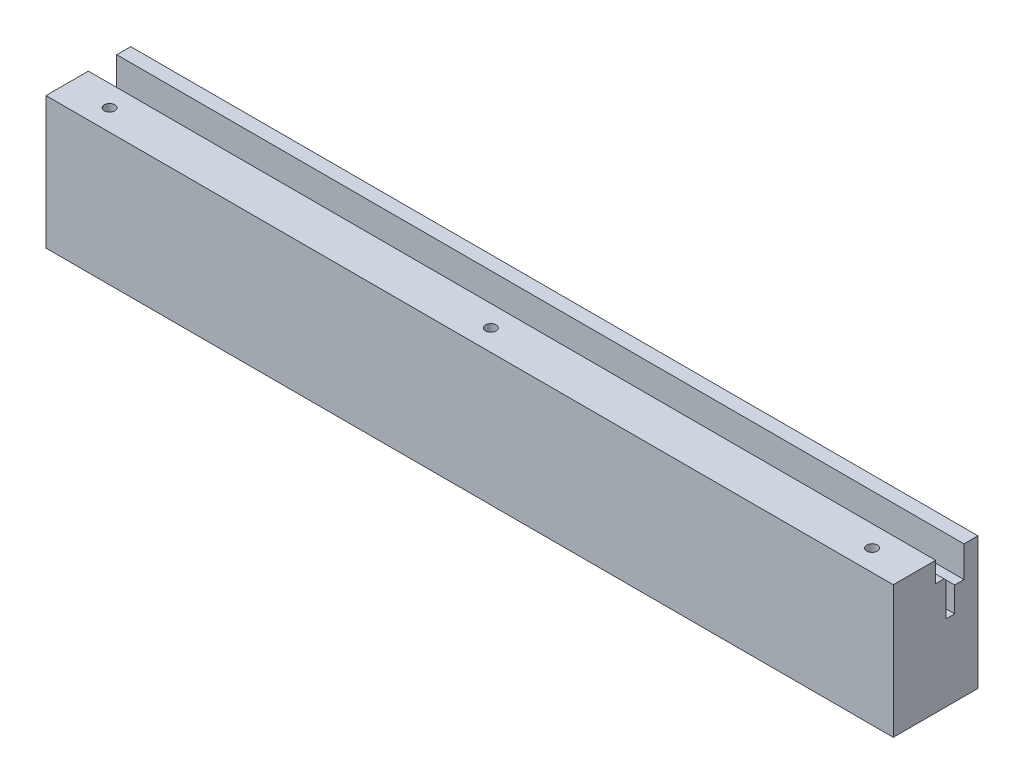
ISO-10303-21;
HEADER;
FILE_DESCRIPTION(('STEP AP214'),'2;1');
FILE_NAME('part.step','',(''),(''),'','','');
FILE_SCHEMA(('AUTOMOTIVE_DESIGN { 1 0 10303 214 1 1 1 1 }'));
ENDSEC;
DATA;
#1=APPLICATION_CONTEXT('core data for automotive mechanical design processes');
#2=APPLICATION_PROTOCOL_DEFINITION('international standard','automotive_design',2000,#1);
#3=PRODUCT_CONTEXT('',#1,'mechanical');
#4=PRODUCT('Part','Part','',(#3));
#5=PRODUCT_RELATED_PRODUCT_CATEGORY('part','',(#4));
#6=PRODUCT_DEFINITION_FORMATION('','',#4);
#7=PRODUCT_DEFINITION_CONTEXT('part definition',#1,'design');
#8=PRODUCT_DEFINITION('design','',#6,#7);
#9=PRODUCT_DEFINITION_SHAPE('','',#8);
#10=(LENGTH_UNIT() NAMED_UNIT(*) SI_UNIT(.MILLI.,.METRE.));
#11=(NAMED_UNIT(*) PLANE_ANGLE_UNIT() SI_UNIT($,.RADIAN.));
#12=(NAMED_UNIT(*) SI_UNIT($,.STERADIAN.) SOLID_ANGLE_UNIT());
#13=UNCERTAINTY_MEASURE_WITH_UNIT(LENGTH_MEASURE(1.E-05),#10,'distance_accuracy_value','');
#14=(GEOMETRIC_REPRESENTATION_CONTEXT(3) GLOBAL_UNCERTAINTY_ASSIGNED_CONTEXT((#13)) GLOBAL_UNIT_ASSIGNED_CONTEXT((#10,
#11,#12)) REPRESENTATION_CONTEXT('',''));
#15=CARTESIAN_POINT('',(0.,0.,0.));
#16=DIRECTION('',(0.,0.,1.));
#17=DIRECTION('',(1.,0.,0.));
#18=AXIS2_PLACEMENT_3D('',#15,#16,#17);
#19=CARTESIAN_POINT('',(0.,1.13686837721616E-13,20.));
#20=DIRECTION('',(1.,0.,0.));
#21=DIRECTION('',(0.,0.,-1.));
#22=AXIS2_PLACEMENT_3D('',#19,#20,#21);
#23=PLANE('',#22);
#24=DIRECTION('',(0.,-1.,0.));
#25=VECTOR('',#24,1.);
#26=CARTESIAN_POINT('',(0.,23.9000000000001,3.30000000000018));
#27=LINE('',#26,#25);
#28=CARTESIAN_POINT('',(0.,31.1999999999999,3.30000000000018));
#29=VERTEX_POINT('',#28);
#30=CARTESIAN_POINT('',(0.,23.9000000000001,3.30000000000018));
#31=VERTEX_POINT('',#30);
#32=EDGE_CURVE('E170',#29,#31,#27,.T.);
#33=ORIENTED_EDGE('',*,*,#32,.F.);
#34=DIRECTION('',(0.,0.,-1.));
#35=VECTOR('',#34,1.);
#36=CARTESIAN_POINT('',(0.,31.2,20.));
#37=LINE('',#36,#35);
#38=CARTESIAN_POINT('',(0.,31.2,0.));
#39=VERTEX_POINT('',#38);
#40=EDGE_CURVE('E78',#29,#39,#37,.T.);
#41=ORIENTED_EDGE('',*,*,#40,.T.);
#42=DIRECTION('',(0.,-1.,0.));
#43=VECTOR('',#42,1.);
#44=CARTESIAN_POINT('',(0.,1.13686837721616E-13,0.));
#45=LINE('',#44,#43);
#46=CARTESIAN_POINT('',(0.,1.13686837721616E-13,0.));
#47=VERTEX_POINT('',#46);
#48=EDGE_CURVE('E199',#39,#47,#45,.T.);
#49=ORIENTED_EDGE('',*,*,#48,.T.);
#50=DIRECTION('',(0.,0.,-1.));
#51=VECTOR('',#50,1.);
#52=CARTESIAN_POINT('',(0.,1.13686837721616E-13,20.));
#53=LINE('',#52,#51);
#54=CARTESIAN_POINT('',(0.,1.13686837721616E-13,20.));
#55=VERTEX_POINT('',#54);
#56=EDGE_CURVE('E12',#55,#47,#53,.T.);
#57=ORIENTED_EDGE('',*,*,#56,.F.);
#58=DIRECTION('',(0.,-1.,0.));
#59=VECTOR('',#58,1.);
#60=CARTESIAN_POINT('',(0.,1.13686837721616E-13,20.));
#61=LINE('',#60,#59);
#62=CARTESIAN_POINT('',(0.,31.2,20.));
#63=VERTEX_POINT('',#62);
#64=EDGE_CURVE('E214',#63,#55,#61,.T.);
#65=ORIENTED_EDGE('',*,*,#64,.F.);
#66=CARTESIAN_POINT('',(0.,31.2,10.));
#67=VERTEX_POINT('',#66);
#68=EDGE_CURVE('E228',#63,#67,#37,.T.);
#69=ORIENTED_EDGE('',*,*,#68,.T.);
#70=DIRECTION('',(0.,1.,-1.89373979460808E-13));
#71=VECTOR('',#70,1.);
#72=CARTESIAN_POINT('',(0.,26.4000000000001,10.0000000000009));
#73=LINE('',#72,#71);
#74=CARTESIAN_POINT('',(0.,26.4000000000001,10.0000000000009));
#75=VERTEX_POINT('',#74);
#76=EDGE_CURVE('E47',#75,#67,#73,.T.);
#77=ORIENTED_EDGE('',*,*,#76,.F.);
#78=DIRECTION('',(0.,0.,1.));
#79=VECTOR('',#78,1.);
#80=CARTESIAN_POINT('',(0.,26.4000000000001,10.0000000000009));
#81=LINE('',#80,#79);
#82=CARTESIAN_POINT('',(0.,26.4000000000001,8.));
#83=VERTEX_POINT('',#82);
#84=EDGE_CURVE('E163',#83,#75,#81,.T.);
#85=ORIENTED_EDGE('',*,*,#84,.F.);
#86=DIRECTION('',(0.,0.707106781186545,0.70710678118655));
#87=VECTOR('',#86,1.);
#88=CARTESIAN_POINT('',(0.,26.4000000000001,8.));
#89=LINE('',#88,#87);
#90=CARTESIAN_POINT('',(0.,25.9000000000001,7.5));
#91=VERTEX_POINT('',#90);
#92=EDGE_CURVE('E161',#91,#83,#89,.T.);
#93=ORIENTED_EDGE('',*,*,#92,.F.);
#94=DIRECTION('',(0.,1.,0.));
#95=VECTOR('',#94,1.);
#96=CARTESIAN_POINT('',(0.,18.,7.5));
#97=LINE('',#96,#95);
#98=CARTESIAN_POINT('',(0.,18.,7.5));
#99=VERTEX_POINT('',#98);
#100=EDGE_CURVE('E141',#99,#91,#97,.T.);
#101=ORIENTED_EDGE('',*,*,#100,.F.);
#102=DIRECTION('',(0.,0.,1.));
#103=VECTOR('',#102,1.);
#104=CARTESIAN_POINT('',(0.,18.,7.5));
#105=LINE('',#104,#103);
#106=CARTESIAN_POINT('',(0.,18.,5.5));
#107=VERTEX_POINT('',#106);
#108=EDGE_CURVE('E152',#107,#99,#105,.T.);
#109=ORIENTED_EDGE('',*,*,#108,.F.);
#110=DIRECTION('',(0.,-1.,0.));
#111=VECTOR('',#110,1.);
#112=CARTESIAN_POINT('',(0.,18.,5.5));
#113=LINE('',#112,#111);
#114=CARTESIAN_POINT('',(0.,23.9000000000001,5.5));
#115=VERTEX_POINT('',#114);
#116=EDGE_CURVE('E149',#115,#107,#113,.T.);
#117=ORIENTED_EDGE('',*,*,#116,.F.);
#118=DIRECTION('',(0.,0.,1.));
#119=VECTOR('',#118,1.);
#120=CARTESIAN_POINT('',(0.,23.9000000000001,5.5));
#121=LINE('',#120,#119);
#122=EDGE_CURVE('E173',#31,#115,#121,.T.);
#123=ORIENTED_EDGE('',*,*,#122,.F.);
#124=EDGE_LOOP('',(#33,#41,#49,#57,#65,#69,#77,#85,#93,#101,#109,#117,#123));
#125=FACE_BOUND('',#124,.T.);
#126=ADVANCED_FACE('F33',(#125),#23,.F.);
#127=CARTESIAN_POINT('',(200.,1.13686837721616E-13,20.));
#128=DIRECTION('',(-1.,0.,0.));
#129=DIRECTION('',(0.,0.,1.));
#130=AXIS2_PLACEMENT_3D('',#127,#128,#129);
#131=PLANE('',#130);
#132=DIRECTION('',(0.,-1.,0.));
#133=VECTOR('',#132,1.);
#134=CARTESIAN_POINT('',(200.,23.9000000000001,3.30000000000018));
#135=LINE('',#134,#133);
#136=CARTESIAN_POINT('',(200.,31.1999999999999,3.30000000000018));
#137=VERTEX_POINT('',#136);
#138=CARTESIAN_POINT('',(200.,23.9000000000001,3.30000000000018));
#139=VERTEX_POINT('',#138);
#140=EDGE_CURVE('E190',#137,#139,#135,.T.);
#141=ORIENTED_EDGE('',*,*,#140,.T.);
#142=DIRECTION('',(0.,0.,1.));
#143=VECTOR('',#142,1.);
#144=CARTESIAN_POINT('',(200.,23.9000000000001,5.5));
#145=LINE('',#144,#143);
#146=CARTESIAN_POINT('',(200.,23.9000000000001,5.5));
#147=VERTEX_POINT('',#146);
#148=EDGE_CURVE('E193',#139,#147,#145,.T.);
#149=ORIENTED_EDGE('',*,*,#148,.T.);
#150=DIRECTION('',(0.,-1.,0.));
#151=VECTOR('',#150,1.);
#152=CARTESIAN_POINT('',(200.,18.,5.5));
#153=LINE('',#152,#151);
#154=CARTESIAN_POINT('',(200.,18.,5.5));
#155=VERTEX_POINT('',#154);
#156=EDGE_CURVE('E157',#147,#155,#153,.T.);
#157=ORIENTED_EDGE('',*,*,#156,.T.);
#158=DIRECTION('',(0.,0.,1.));
#159=VECTOR('',#158,1.);
#160=CARTESIAN_POINT('',(200.,18.,7.5));
#161=LINE('',#160,#159);
#162=CARTESIAN_POINT('',(200.,18.,7.5));
#163=VERTEX_POINT('',#162);
#164=EDGE_CURVE('E177',#155,#163,#161,.T.);
#165=ORIENTED_EDGE('',*,*,#164,.T.);
#166=DIRECTION('',(0.,1.,0.));
#167=VECTOR('',#166,1.);
#168=CARTESIAN_POINT('',(200.,18.,7.5));
#169=LINE('',#168,#167);
#170=CARTESIAN_POINT('',(200.,25.9000000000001,7.5));
#171=VERTEX_POINT('',#170);
#172=EDGE_CURVE('E144',#163,#171,#169,.T.);
#173=ORIENTED_EDGE('',*,*,#172,.T.);
#174=DIRECTION('',(0.,0.707106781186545,0.70710678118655));
#175=VECTOR('',#174,1.);
#176=CARTESIAN_POINT('',(200.,26.4000000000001,8.));
#177=LINE('',#176,#175);
#178=CARTESIAN_POINT('',(200.,26.4000000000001,8.));
#179=VERTEX_POINT('',#178);
#180=EDGE_CURVE('E181',#171,#179,#177,.T.);
#181=ORIENTED_EDGE('',*,*,#180,.T.);
#182=DIRECTION('',(0.,0.,1.));
#183=VECTOR('',#182,1.);
#184=CARTESIAN_POINT('',(200.,26.4000000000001,10.0000000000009));
#185=LINE('',#184,#183);
#186=CARTESIAN_POINT('',(200.,26.4000000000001,10.0000000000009));
#187=VERTEX_POINT('',#186);
#188=EDGE_CURVE('E184',#179,#187,#185,.T.);
#189=ORIENTED_EDGE('',*,*,#188,.T.);
#190=DIRECTION('',(0.,1.,-1.89373979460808E-13));
#191=VECTOR('',#190,1.);
#192=CARTESIAN_POINT('',(200.,26.4000000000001,10.0000000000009));
#193=LINE('',#192,#191);
#194=CARTESIAN_POINT('',(200.,31.1999999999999,10.));
#195=VERTEX_POINT('',#194);
#196=EDGE_CURVE('E187',#187,#195,#193,.T.);
#197=ORIENTED_EDGE('',*,*,#196,.T.);
#198=DIRECTION('',(0.,0.,-1.));
#199=VECTOR('',#198,1.);
#200=CARTESIAN_POINT('',(200.,31.2,20.));
#201=LINE('',#200,#199);
#202=CARTESIAN_POINT('',(200.,31.2,20.));
#203=VERTEX_POINT('',#202);
#204=EDGE_CURVE('E232',#203,#195,#201,.T.);
#205=ORIENTED_EDGE('',*,*,#204,.F.);
#206=DIRECTION('',(0.,1.,0.));
#207=VECTOR('',#206,1.);
#208=CARTESIAN_POINT('',(200.,1.13686837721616E-13,20.));
#209=LINE('',#208,#207);
#210=CARTESIAN_POINT('',(200.,1.13686837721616E-13,20.));
#211=VERTEX_POINT('',#210);
#212=EDGE_CURVE('E218',#211,#203,#209,.T.);
#213=ORIENTED_EDGE('',*,*,#212,.F.);
#214=DIRECTION('',(0.,0.,-1.));
#215=VECTOR('',#214,1.);
#216=CARTESIAN_POINT('',(200.,1.13686837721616E-13,20.));
#217=LINE('',#216,#215);
#218=CARTESIAN_POINT('',(200.,1.13686837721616E-13,0.));
#219=VERTEX_POINT('',#218);
#220=EDGE_CURVE('E40',#211,#219,#217,.T.);
#221=ORIENTED_EDGE('',*,*,#220,.T.);
#222=DIRECTION('',(0.,1.,0.));
#223=VECTOR('',#222,1.);
#224=CARTESIAN_POINT('',(200.,1.13686837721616E-13,0.));
#225=LINE('',#224,#223);
#226=CARTESIAN_POINT('',(200.,31.2,0.));
#227=VERTEX_POINT('',#226);
#228=EDGE_CURVE('E224',#219,#227,#225,.T.);
#229=ORIENTED_EDGE('',*,*,#228,.T.);
#230=EDGE_CURVE('E231',#137,#227,#201,.T.);
#231=ORIENTED_EDGE('',*,*,#230,.F.);
#232=EDGE_LOOP('',(#141,#149,#157,#165,#173,#181,#189,#197,#205,#213,#221,#229,#231));
#233=FACE_BOUND('',#232,.T.);
#234=ADVANCED_FACE('F238',(#233),#131,.F.);
#235=CARTESIAN_POINT('',(0.,31.2,20.));
#236=DIRECTION('',(0.,-1.,0.));
#237=DIRECTION('',(0.,0.,-1.));
#238=AXIS2_PLACEMENT_3D('',#235,#236,#237);
#239=PLANE('',#238);
#240=DIRECTION('',(1.,0.,0.));
#241=VECTOR('',#240,1.);
#242=CARTESIAN_POINT('',(0.,31.1999999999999,3.30000000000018));
#243=LINE('',#242,#241);
#244=EDGE_CURVE('E204',#29,#137,#243,.T.);
#245=ORIENTED_EDGE('',*,*,#244,.T.);
#246=ORIENTED_EDGE('',*,*,#230,.T.);
#247=DIRECTION('',(-1.,0.,0.));
#248=VECTOR('',#247,1.);
#249=CARTESIAN_POINT('',(0.,31.2,0.));
#250=LINE('',#249,#248);
#251=EDGE_CURVE('E216',#227,#39,#250,.T.);
#252=ORIENTED_EDGE('',*,*,#251,.T.);
#253=ORIENTED_EDGE('',*,*,#40,.F.);
#254=EDGE_LOOP('',(#245,#246,#252,#253));
#255=FACE_BOUND('',#254,.T.);
#256=ADVANCED_FACE('F246',(#255),#239,.F.);
#257=CARTESIAN_POINT('',(190.,31.2,15.));
#258=DIRECTION('',(0.,1.,0.));
#259=DIRECTION('',(0.,0.,1.));
#260=AXIS2_PLACEMENT_3D('',#257,#258,#259);
#261=CIRCLE('',#260,1.25);
#262=CARTESIAN_POINT('',(190.,31.2,16.25));
#263=VERTEX_POINT('',#262);
#264=EDGE_CURVE('E297',#263,#263,#261,.T.);
#265=ORIENTED_EDGE('',*,*,#264,.F.);
#266=EDGE_LOOP('',(#265));
#267=FACE_BOUND('',#266,.T.);
#268=CARTESIAN_POINT('',(100.,31.2,15.));
#269=DIRECTION('',(0.,1.,0.));
#270=DIRECTION('',(0.,0.,1.));
#271=AXIS2_PLACEMENT_3D('',#268,#269,#270);
#272=CIRCLE('',#271,1.25);
#273=CARTESIAN_POINT('',(100.,31.2,16.25));
#274=VERTEX_POINT('',#273);
#275=EDGE_CURVE('E301',#274,#274,#272,.T.);
#276=ORIENTED_EDGE('',*,*,#275,.F.);
#277=EDGE_LOOP('',(#276));
#278=FACE_BOUND('',#277,.T.);
#279=CARTESIAN_POINT('',(10.,31.2,15.));
#280=DIRECTION('',(0.,1.,0.));
#281=DIRECTION('',(0.,0.,1.));
#282=AXIS2_PLACEMENT_3D('',#279,#280,#281);
#283=CIRCLE('',#282,1.25);
#284=CARTESIAN_POINT('',(10.,31.2,16.25));
#285=VERTEX_POINT('',#284);
#286=EDGE_CURVE('E304',#285,#285,#283,.T.);
#287=ORIENTED_EDGE('',*,*,#286,.F.);
#288=EDGE_LOOP('',(#287));
#289=FACE_BOUND('',#288,.T.);
#290=DIRECTION('',(1.,0.,0.));
#291=VECTOR('',#290,1.);
#292=CARTESIAN_POINT('',(0.,31.1999999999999,10.));
#293=LINE('',#292,#291);
#294=EDGE_CURVE('E207',#67,#195,#293,.T.);
#295=ORIENTED_EDGE('',*,*,#294,.F.);
#296=ORIENTED_EDGE('',*,*,#68,.F.);
#297=DIRECTION('',(-1.,0.,0.));
#298=VECTOR('',#297,1.);
#299=CARTESIAN_POINT('',(0.,31.2,20.));
#300=LINE('',#299,#298);
#301=EDGE_CURVE('E56',#203,#63,#300,.T.);
#302=ORIENTED_EDGE('',*,*,#301,.F.);
#303=ORIENTED_EDGE('',*,*,#204,.T.);
#304=EDGE_LOOP('',(#295,#296,#302,#303));
#305=FACE_BOUND('',#304,.T.);
#306=ADVANCED_FACE('F265',(#267,#278,#289,#305),#239,.F.);
#307=CARTESIAN_POINT('',(0.,1.13686837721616E-13,20.));
#308=DIRECTION('',(0.,1.,0.));
#309=DIRECTION('',(0.,0.,1.));
#310=AXIS2_PLACEMENT_3D('',#307,#308,#309);
#311=PLANE('',#310);
#312=CARTESIAN_POINT('',(180.,0.,15.));
#313=DIRECTION('',(0.,-1.,0.));
#314=DIRECTION('',(0.,0.,-1.));
#315=AXIS2_PLACEMENT_3D('',#312,#313,#314);
#316=CIRCLE('',#315,2.09999999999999);
#317=CARTESIAN_POINT('',(180.,0.,12.9));
#318=VERTEX_POINT('',#317);
#319=EDGE_CURVE('E324',#318,#318,#316,.T.);
#320=ORIENTED_EDGE('',*,*,#319,.F.);
#321=EDGE_LOOP('',(#320));
#322=FACE_BOUND('',#321,.T.);
#323=CARTESIAN_POINT('',(132.400000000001,0.,15.));
#324=DIRECTION('',(0.,-1.,0.));
#325=DIRECTION('',(0.,0.,-1.));
#326=AXIS2_PLACEMENT_3D('',#323,#324,#325);
#327=CIRCLE('',#326,2.09999999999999);
#328=CARTESIAN_POINT('',(132.400000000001,0.,12.9));
#329=VERTEX_POINT('',#328);
#330=EDGE_CURVE('E318',#329,#329,#327,.T.);
#331=ORIENTED_EDGE('',*,*,#330,.F.);
#332=EDGE_LOOP('',(#331));
#333=FACE_BOUND('',#332,.T.);
#334=DIRECTION('',(1.,0.,0.));
#335=VECTOR('',#334,1.);
#336=CARTESIAN_POINT('',(0.,1.13686837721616E-13,0.));
#337=LINE('',#336,#335);
#338=EDGE_CURVE('E222',#47,#219,#337,.T.);
#339=ORIENTED_EDGE('',*,*,#338,.T.);
#340=ORIENTED_EDGE('',*,*,#220,.F.);
#341=DIRECTION('',(1.,0.,0.));
#342=VECTOR('',#341,1.);
#343=CARTESIAN_POINT('',(0.,1.13686837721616E-13,20.));
#344=LINE('',#343,#342);
#345=EDGE_CURVE('E85',#55,#211,#344,.T.);
#346=ORIENTED_EDGE('',*,*,#345,.F.);
#347=ORIENTED_EDGE('',*,*,#56,.T.);
#348=EDGE_LOOP('',(#339,#340,#346,#347));
#349=FACE_BOUND('',#348,.T.);
#350=ADVANCED_FACE('F270',(#322,#333,#349),#311,.F.);
#351=CARTESIAN_POINT('',(0.,31.2,20.));
#352=DIRECTION('',(0.,0.,-1.));
#353=DIRECTION('',(-1.,0.,0.));
#354=AXIS2_PLACEMENT_3D('',#351,#352,#353);
#355=PLANE('',#354);
#356=ORIENTED_EDGE('',*,*,#64,.T.);
#357=ORIENTED_EDGE('',*,*,#345,.T.);
#358=ORIENTED_EDGE('',*,*,#212,.T.);
#359=ORIENTED_EDGE('',*,*,#301,.T.);
#360=EDGE_LOOP('',(#356,#357,#358,#359));
#361=FACE_BOUND('',#360,.T.);
#362=ADVANCED_FACE('F268',(#361),#355,.F.);
#363=CARTESIAN_POINT('',(0.,31.2,0.));
#364=DIRECTION('',(0.,0.,-1.));
#365=DIRECTION('',(-1.,0.,0.));
#366=AXIS2_PLACEMENT_3D('',#363,#364,#365);
#367=PLANE('',#366);
#368=ORIENTED_EDGE('',*,*,#48,.F.);
#369=ORIENTED_EDGE('',*,*,#251,.F.);
#370=ORIENTED_EDGE('',*,*,#228,.F.);
#371=ORIENTED_EDGE('',*,*,#338,.F.);
#372=EDGE_LOOP('',(#368,#369,#370,#371));
#373=FACE_BOUND('',#372,.T.);
#374=ADVANCED_FACE('F244',(#373),#367,.T.);
#375=CARTESIAN_POINT('',(0.,18.,7.5));
#376=DIRECTION('',(0.,1.,0.));
#377=DIRECTION('',(0.,0.,1.));
#378=AXIS2_PLACEMENT_3D('',#375,#376,#377);
#379=PLANE('',#378);
#380=ORIENTED_EDGE('',*,*,#164,.F.);
#381=DIRECTION('',(1.,0.,0.));
#382=VECTOR('',#381,1.);
#383=CARTESIAN_POINT('',(0.,18.,5.5));
#384=LINE('',#383,#382);
#385=EDGE_CURVE('E154',#107,#155,#384,.T.);
#386=ORIENTED_EDGE('',*,*,#385,.F.);
#387=ORIENTED_EDGE('',*,*,#108,.T.);
#388=DIRECTION('',(1.,0.,0.));
#389=VECTOR('',#388,1.);
#390=CARTESIAN_POINT('',(0.,18.,7.5));
#391=LINE('',#390,#389);
#392=EDGE_CURVE('E137',#99,#163,#391,.T.);
#393=ORIENTED_EDGE('',*,*,#392,.T.);
#394=EDGE_LOOP('',(#380,#386,#387,#393));
#395=FACE_BOUND('',#394,.T.);
#396=ADVANCED_FACE('F153',(#395),#379,.T.);
#397=CARTESIAN_POINT('',(0.,18.,5.5));
#398=DIRECTION('',(0.,0.,1.));
#399=DIRECTION('',(1.,0.,0.));
#400=AXIS2_PLACEMENT_3D('',#397,#398,#399);
#401=PLANE('',#400);
#402=ORIENTED_EDGE('',*,*,#156,.F.);
#403=DIRECTION('',(1.,0.,0.));
#404=VECTOR('',#403,1.);
#405=CARTESIAN_POINT('',(0.,23.9000000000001,5.5));
#406=LINE('',#405,#404);
#407=EDGE_CURVE('E200',#115,#147,#406,.T.);
#408=ORIENTED_EDGE('',*,*,#407,.F.);
#409=ORIENTED_EDGE('',*,*,#116,.T.);
#410=ORIENTED_EDGE('',*,*,#385,.T.);
#411=EDGE_LOOP('',(#402,#408,#409,#410));
#412=FACE_BOUND('',#411,.T.);
#413=ADVANCED_FACE('F255',(#412),#401,.T.);
#414=CARTESIAN_POINT('',(0.,23.9000000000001,5.5));
#415=DIRECTION('',(0.,1.,0.));
#416=DIRECTION('',(0.,0.,1.));
#417=AXIS2_PLACEMENT_3D('',#414,#415,#416);
#418=PLANE('',#417);
#419=ORIENTED_EDGE('',*,*,#148,.F.);
#420=DIRECTION('',(1.,0.,0.));
#421=VECTOR('',#420,1.);
#422=CARTESIAN_POINT('',(0.,23.9000000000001,3.30000000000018));
#423=LINE('',#422,#421);
#424=EDGE_CURVE('E202',#31,#139,#423,.T.);
#425=ORIENTED_EDGE('',*,*,#424,.F.);
#426=ORIENTED_EDGE('',*,*,#122,.T.);
#427=ORIENTED_EDGE('',*,*,#407,.T.);
#428=EDGE_LOOP('',(#419,#425,#426,#427));
#429=FACE_BOUND('',#428,.T.);
#430=ADVANCED_FACE('F252',(#429),#418,.T.);
#431=CARTESIAN_POINT('',(0.,23.9000000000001,3.30000000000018));
#432=DIRECTION('',(0.,0.,1.));
#433=DIRECTION('',(1.,0.,0.));
#434=AXIS2_PLACEMENT_3D('',#431,#432,#433);
#435=PLANE('',#434);
#436=ORIENTED_EDGE('',*,*,#140,.F.);
#437=ORIENTED_EDGE('',*,*,#244,.F.);
#438=ORIENTED_EDGE('',*,*,#32,.T.);
#439=ORIENTED_EDGE('',*,*,#424,.T.);
#440=EDGE_LOOP('',(#436,#437,#438,#439));
#441=FACE_BOUND('',#440,.T.);
#442=ADVANCED_FACE('F249',(#441),#435,.T.);
#443=CARTESIAN_POINT('',(0.,26.4000000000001,10.0000000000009));
#444=DIRECTION('',(0.,-1.89373979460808E-13,-1.));
#445=DIRECTION('',(0.,1.,-1.89373979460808E-13));
#446=AXIS2_PLACEMENT_3D('',#443,#444,#445);
#447=PLANE('',#446);
#448=ORIENTED_EDGE('',*,*,#196,.F.);
#449=DIRECTION('',(1.,0.,0.));
#450=VECTOR('',#449,1.);
#451=CARTESIAN_POINT('',(0.,26.4000000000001,10.0000000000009));
#452=LINE('',#451,#450);
#453=EDGE_CURVE('E209',#75,#187,#452,.T.);
#454=ORIENTED_EDGE('',*,*,#453,.F.);
#455=ORIENTED_EDGE('',*,*,#76,.T.);
#456=ORIENTED_EDGE('',*,*,#294,.T.);
#457=EDGE_LOOP('',(#448,#454,#455,#456));
#458=FACE_BOUND('',#457,.T.);
#459=ADVANCED_FACE('F263',(#458),#447,.T.);
#460=CARTESIAN_POINT('',(0.,26.4000000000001,10.0000000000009));
#461=DIRECTION('',(0.,1.,0.));
#462=DIRECTION('',(0.,0.,1.));
#463=AXIS2_PLACEMENT_3D('',#460,#461,#462);
#464=PLANE('',#463);
#465=ORIENTED_EDGE('',*,*,#188,.F.);
#466=DIRECTION('',(1.,0.,0.));
#467=VECTOR('',#466,1.);
#468=CARTESIAN_POINT('',(0.,26.4000000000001,8.));
#469=LINE('',#468,#467);
#470=EDGE_CURVE('E211',#83,#179,#469,.T.);
#471=ORIENTED_EDGE('',*,*,#470,.F.);
#472=ORIENTED_EDGE('',*,*,#84,.T.);
#473=ORIENTED_EDGE('',*,*,#453,.T.);
#474=EDGE_LOOP('',(#465,#471,#472,#473));
#475=FACE_BOUND('',#474,.T.);
#476=ADVANCED_FACE('F261',(#475),#464,.T.);
#477=CARTESIAN_POINT('',(0.,26.4000000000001,8.));
#478=DIRECTION('',(0.,0.70710678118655,-0.707106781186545));
#479=DIRECTION('',(0.,0.707106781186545,0.70710678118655));
#480=AXIS2_PLACEMENT_3D('',#477,#478,#479);
#481=PLANE('',#480);
#482=ORIENTED_EDGE('',*,*,#180,.F.);
#483=DIRECTION('',(1.,0.,0.));
#484=VECTOR('',#483,1.);
#485=CARTESIAN_POINT('',(0.,25.9000000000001,7.5));
#486=LINE('',#485,#484);
#487=EDGE_CURVE('E148',#91,#171,#486,.T.);
#488=ORIENTED_EDGE('',*,*,#487,.F.);
#489=ORIENTED_EDGE('',*,*,#92,.T.);
#490=ORIENTED_EDGE('',*,*,#470,.T.);
#491=EDGE_LOOP('',(#482,#488,#489,#490));
#492=FACE_BOUND('',#491,.T.);
#493=ADVANCED_FACE('F259',(#492),#481,.T.);
#494=CARTESIAN_POINT('',(0.,18.,7.5));
#495=DIRECTION('',(0.,0.,-1.));
#496=DIRECTION('',(-1.,0.,0.));
#497=AXIS2_PLACEMENT_3D('',#494,#495,#496);
#498=PLANE('',#497);
#499=ORIENTED_EDGE('',*,*,#172,.F.);
#500=ORIENTED_EDGE('',*,*,#392,.F.);
#501=ORIENTED_EDGE('',*,*,#100,.T.);
#502=ORIENTED_EDGE('',*,*,#487,.T.);
#503=EDGE_LOOP('',(#499,#500,#501,#502));
#504=FACE_BOUND('',#503,.T.);
#505=ADVANCED_FACE('F139',(#504),#498,.T.);
#506=CARTESIAN_POINT('',(10.,11.2,15.));
#507=DIRECTION('',(0.,1.,0.));
#508=DIRECTION('',(0.,0.,1.));
#509=AXIS2_PLACEMENT_3D('',#506,#507,#508);
#510=CYLINDRICAL_SURFACE('',#509,1.25);
#511=CARTESIAN_POINT('',(10.,11.2,15.));
#512=DIRECTION('',(0.,1.,0.));
#513=DIRECTION('',(0.,0.,1.));
#514=AXIS2_PLACEMENT_3D('',#511,#512,#513);
#515=CIRCLE('',#514,1.25);
#516=CARTESIAN_POINT('',(10.,11.2,16.25));
#517=VERTEX_POINT('',#516);
#518=EDGE_CURVE('E179',#517,#517,#515,.T.);
#519=ORIENTED_EDGE('',*,*,#518,.F.);
#520=EDGE_LOOP('',(#519));
#521=FACE_BOUND('',#520,.T.);
#522=ORIENTED_EDGE('',*,*,#286,.T.);
#523=EDGE_LOOP('',(#522));
#524=FACE_BOUND('',#523,.T.);
#525=ADVANCED_FACE('F371',(#521,#524),#510,.F.);
#526=CARTESIAN_POINT('',(10.,11.2,15.));
#527=DIRECTION('',(0.,1.,0.));
#528=DIRECTION('',(0.,0.,1.));
#529=AXIS2_PLACEMENT_3D('',#526,#527,#528);
#530=PLANE('',#529);
#531=ORIENTED_EDGE('',*,*,#518,.T.);
#532=EDGE_LOOP('',(#531));
#533=FACE_BOUND('',#532,.T.);
#534=ADVANCED_FACE('F367',(#533),#530,.T.);
#535=CARTESIAN_POINT('',(100.,11.2,15.));
#536=DIRECTION('',(0.,1.,0.));
#537=DIRECTION('',(0.,0.,1.));
#538=AXIS2_PLACEMENT_3D('',#535,#536,#537);
#539=CYLINDRICAL_SURFACE('',#538,1.25);
#540=CARTESIAN_POINT('',(100.,11.2,15.));
#541=DIRECTION('',(0.,1.,0.));
#542=DIRECTION('',(0.,0.,1.));
#543=AXIS2_PLACEMENT_3D('',#540,#541,#542);
#544=CIRCLE('',#543,1.25);
#545=CARTESIAN_POINT('',(100.,11.2,16.25));
#546=VERTEX_POINT('',#545);
#547=EDGE_CURVE('E306',#546,#546,#544,.T.);
#548=ORIENTED_EDGE('',*,*,#547,.F.);
#549=EDGE_LOOP('',(#548));
#550=FACE_BOUND('',#549,.T.);
#551=ORIENTED_EDGE('',*,*,#275,.T.);
#552=EDGE_LOOP('',(#551));
#553=FACE_BOUND('',#552,.T.);
#554=ADVANCED_FACE('F363',(#550,#553),#539,.F.);
#555=CARTESIAN_POINT('',(100.,11.2,15.));
#556=DIRECTION('',(0.,1.,0.));
#557=DIRECTION('',(0.,0.,1.));
#558=AXIS2_PLACEMENT_3D('',#555,#556,#557);
#559=PLANE('',#558);
#560=ORIENTED_EDGE('',*,*,#547,.T.);
#561=EDGE_LOOP('',(#560));
#562=FACE_BOUND('',#561,.T.);
#563=ADVANCED_FACE('F359',(#562),#559,.T.);
#564=CARTESIAN_POINT('',(190.,11.2,15.));
#565=DIRECTION('',(0.,1.,0.));
#566=DIRECTION('',(0.,0.,1.));
#567=AXIS2_PLACEMENT_3D('',#564,#565,#566);
#568=CYLINDRICAL_SURFACE('',#567,1.25);
#569=CARTESIAN_POINT('',(190.,11.2,15.));
#570=DIRECTION('',(0.,1.,0.));
#571=DIRECTION('',(0.,0.,1.));
#572=AXIS2_PLACEMENT_3D('',#569,#570,#571);
#573=CIRCLE('',#572,1.25);
#574=CARTESIAN_POINT('',(190.,11.2,16.25));
#575=VERTEX_POINT('',#574);
#576=EDGE_CURVE('E312',#575,#575,#573,.T.);
#577=ORIENTED_EDGE('',*,*,#576,.F.);
#578=EDGE_LOOP('',(#577));
#579=FACE_BOUND('',#578,.T.);
#580=ORIENTED_EDGE('',*,*,#264,.T.);
#581=EDGE_LOOP('',(#580));
#582=FACE_BOUND('',#581,.T.);
#583=ADVANCED_FACE('F352',(#579,#582),#568,.F.);
#584=CARTESIAN_POINT('',(190.,11.2,15.));
#585=DIRECTION('',(0.,1.,0.));
#586=DIRECTION('',(0.,0.,1.));
#587=AXIS2_PLACEMENT_3D('',#584,#585,#586);
#588=PLANE('',#587);
#589=ORIENTED_EDGE('',*,*,#576,.T.);
#590=EDGE_LOOP('',(#589));
#591=FACE_BOUND('',#590,.T.);
#592=ADVANCED_FACE('F343',(#591),#588,.T.);
#593=CARTESIAN_POINT('',(132.400000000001,20.,15.));
#594=DIRECTION('',(0.,-1.,0.));
#595=DIRECTION('',(0.,0.,-1.));
#596=AXIS2_PLACEMENT_3D('',#593,#594,#595);
#597=CYLINDRICAL_SURFACE('',#596,2.09999999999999);
#598=CARTESIAN_POINT('',(132.400000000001,20.,15.));
#599=DIRECTION('',(0.,-1.,0.));
#600=DIRECTION('',(0.,0.,-1.));
#601=AXIS2_PLACEMENT_3D('',#598,#599,#600);
#602=CIRCLE('',#601,2.09999999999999);
#603=CARTESIAN_POINT('',(132.400000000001,20.,12.9));
#604=VERTEX_POINT('',#603);
#605=EDGE_CURVE('E315',#604,#604,#602,.T.);
#606=ORIENTED_EDGE('',*,*,#605,.F.);
#607=EDGE_LOOP('',(#606));
#608=FACE_BOUND('',#607,.T.);
#609=ORIENTED_EDGE('',*,*,#330,.T.);
#610=EDGE_LOOP('',(#609));
#611=FACE_BOUND('',#610,.T.);
#612=ADVANCED_FACE('F341',(#608,#611),#597,.F.);
#613=CARTESIAN_POINT('',(132.400000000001,20.,15.));
#614=DIRECTION('',(0.,-1.,0.));
#615=DIRECTION('',(0.,0.,-1.));
#616=AXIS2_PLACEMENT_3D('',#613,#614,#615);
#617=PLANE('',#616);
#618=ORIENTED_EDGE('',*,*,#605,.T.);
#619=EDGE_LOOP('',(#618));
#620=FACE_BOUND('',#619,.T.);
#621=ADVANCED_FACE('F335',(#620),#617,.T.);
#622=CARTESIAN_POINT('',(180.,20.,15.));
#623=DIRECTION('',(0.,-1.,0.));
#624=DIRECTION('',(0.,0.,-1.));
#625=AXIS2_PLACEMENT_3D('',#622,#623,#624);
#626=CYLINDRICAL_SURFACE('',#625,2.09999999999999);
#627=CARTESIAN_POINT('',(180.,20.,15.));
#628=DIRECTION('',(0.,-1.,0.));
#629=DIRECTION('',(0.,0.,-1.));
#630=AXIS2_PLACEMENT_3D('',#627,#628,#629);
#631=CIRCLE('',#630,2.09999999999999);
#632=CARTESIAN_POINT('',(180.,20.,12.9));
#633=VERTEX_POINT('',#632);
#634=EDGE_CURVE('E321',#633,#633,#631,.T.);
#635=ORIENTED_EDGE('',*,*,#634,.F.);
#636=EDGE_LOOP('',(#635));
#637=FACE_BOUND('',#636,.T.);
#638=ORIENTED_EDGE('',*,*,#319,.T.);
#639=EDGE_LOOP('',(#638));
#640=FACE_BOUND('',#639,.T.);
#641=ADVANCED_FACE('F332',(#637,#640),#626,.F.);
#642=CARTESIAN_POINT('',(180.,20.,15.));
#643=DIRECTION('',(0.,-1.,0.));
#644=DIRECTION('',(0.,0.,-1.));
#645=AXIS2_PLACEMENT_3D('',#642,#643,#644);
#646=PLANE('',#645);
#647=ORIENTED_EDGE('',*,*,#634,.T.);
#648=EDGE_LOOP('',(#647));
#649=FACE_BOUND('',#648,.T.);
#650=ADVANCED_FACE('F330',(#649),#646,.T.);
#651=CLOSED_SHELL('',(#126,#234,#256,#306,#350,#362,#374,#396,#413,#430,#442,#459,#476,#493,
#505,#525,#534,#554,#563,#583,#592,#612,#621,#641,#650));
#652=MANIFOLD_SOLID_BREP('B2',#651);
#653=ADVANCED_BREP_SHAPE_REPRESENTATION('',(#18,#652),#14);
#654=SHAPE_DEFINITION_REPRESENTATION(#9,#653);
ENDSEC;
END-ISO-10303-21;
